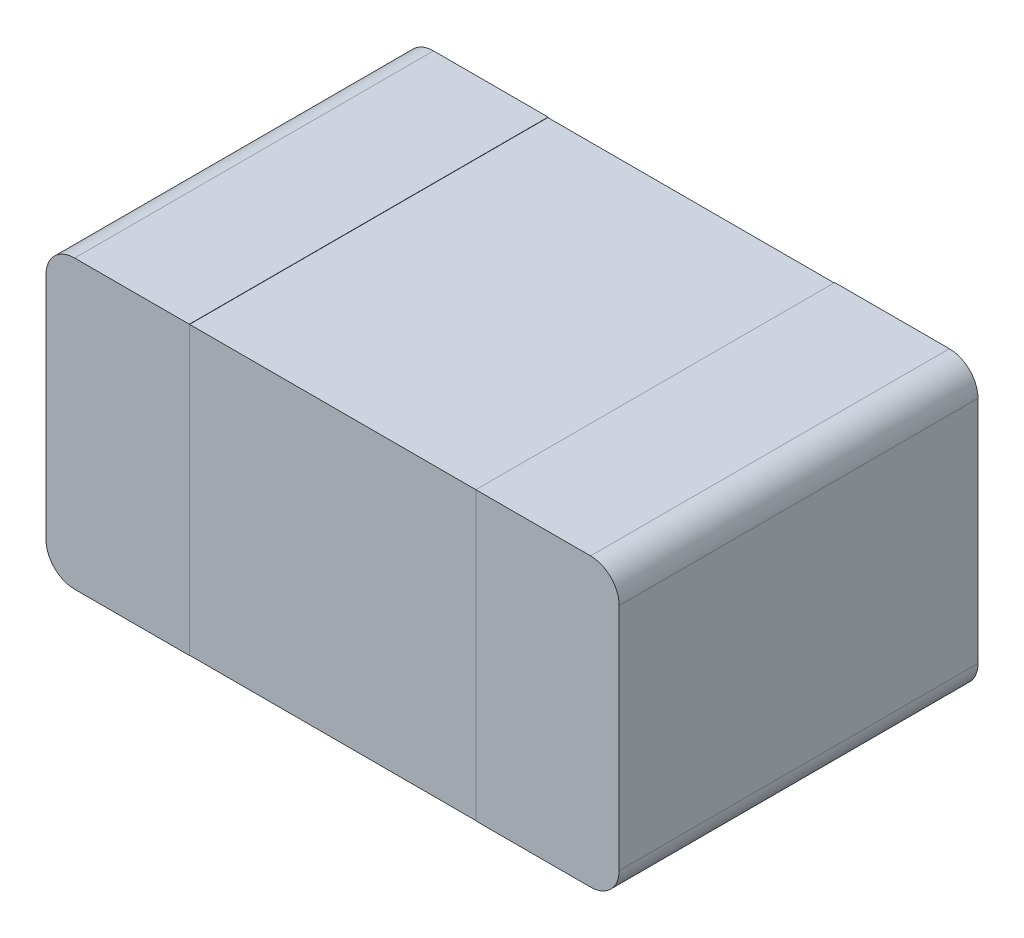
ISO-10303-21;
HEADER;
FILE_DESCRIPTION(('STEP AP214'),'2;1');
FILE_NAME('part.step','',(''),(''),'','','');
FILE_SCHEMA(('AUTOMOTIVE_DESIGN { 1 0 10303 214 1 1 1 1 }'));
ENDSEC;
DATA;
#1=APPLICATION_CONTEXT('core data for automotive mechanical design processes');
#2=APPLICATION_PROTOCOL_DEFINITION('international standard','automotive_design',2000,#1);
#3=PRODUCT_CONTEXT('',#1,'mechanical');
#4=PRODUCT('Part','Part','',(#3));
#5=PRODUCT_RELATED_PRODUCT_CATEGORY('part','',(#4));
#6=PRODUCT_DEFINITION_FORMATION('','',#4);
#7=PRODUCT_DEFINITION_CONTEXT('part definition',#1,'design');
#8=PRODUCT_DEFINITION('design','',#6,#7);
#9=PRODUCT_DEFINITION_SHAPE('','',#8);
#10=(LENGTH_UNIT() NAMED_UNIT(*) SI_UNIT(.MILLI.,.METRE.));
#11=(NAMED_UNIT(*) PLANE_ANGLE_UNIT() SI_UNIT($,.RADIAN.));
#12=(NAMED_UNIT(*) SI_UNIT($,.STERADIAN.) SOLID_ANGLE_UNIT());
#13=UNCERTAINTY_MEASURE_WITH_UNIT(LENGTH_MEASURE(1.E-05),#10,'distance_accuracy_value','');
#14=(GEOMETRIC_REPRESENTATION_CONTEXT(3) GLOBAL_UNCERTAINTY_ASSIGNED_CONTEXT((#13)) GLOBAL_UNIT_ASSIGNED_CONTEXT((#10,
#11,#12)) REPRESENTATION_CONTEXT('',''));
#15=CARTESIAN_POINT('',(0.,0.,0.));
#16=DIRECTION('',(0.,0.,1.));
#17=DIRECTION('',(1.,0.,0.));
#18=AXIS2_PLACEMENT_3D('',#15,#16,#17);
#19=CARTESIAN_POINT('',(-0.9,0.901,0.));
#20=DIRECTION('',(0.,0.,-1.));
#21=DIRECTION('',(-1.,0.,0.));
#22=AXIS2_PLACEMENT_3D('',#19,#20,#21);
#23=CYLINDRICAL_SURFACE('',#22,0.0999999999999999);
#24=CARTESIAN_POINT('',(-0.9,0.901,0.626));
#25=DIRECTION('',(0.,0.,-1.));
#26=DIRECTION('',(-1.,0.,0.));
#27=AXIS2_PLACEMENT_3D('',#24,#25,#26);
#28=CIRCLE('',#27,0.0999999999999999);
#29=CARTESIAN_POINT('',(-1.,0.901,0.626));
#30=VERTEX_POINT('',#29);
#31=CARTESIAN_POINT('',(-0.9,1.001,0.626));
#32=VERTEX_POINT('',#31);
#33=EDGE_CURVE('E110',#30,#32,#28,.T.);
#34=ORIENTED_EDGE('',*,*,#33,.T.);
#35=DIRECTION('',(0.,0.,1.));
#36=VECTOR('',#35,1.);
#37=CARTESIAN_POINT('',(-0.9,1.001,0.));
#38=LINE('',#37,#36);
#39=CARTESIAN_POINT('',(-0.9,1.001,-0.626));
#40=VERTEX_POINT('',#39);
#41=EDGE_CURVE('E109',#40,#32,#38,.T.);
#42=ORIENTED_EDGE('',*,*,#41,.F.);
#43=CARTESIAN_POINT('',(-0.9,0.901,-0.626));
#44=DIRECTION('',(0.,0.,-1.));
#45=DIRECTION('',(-1.,0.,0.));
#46=AXIS2_PLACEMENT_3D('',#43,#44,#45);
#47=CIRCLE('',#46,0.0999999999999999);
#48=CARTESIAN_POINT('',(-1.,0.901,-0.626));
#49=VERTEX_POINT('',#48);
#50=EDGE_CURVE('E22',#49,#40,#47,.T.);
#51=ORIENTED_EDGE('',*,*,#50,.F.);
#52=DIRECTION('',(0.,0.,-1.));
#53=VECTOR('',#52,1.);
#54=CARTESIAN_POINT('',(-1.,0.901,-0.625));
#55=LINE('',#54,#53);
#56=EDGE_CURVE('E92',#49,#30,#55,.F.);
#57=ORIENTED_EDGE('',*,*,#56,.T.);
#58=EDGE_LOOP('',(#34,#42,#51,#57));
#59=FACE_BOUND('',#58,.T.);
#60=ADVANCED_FACE('F19',(#59),#23,.T.);
#61=CARTESIAN_POINT('',(-1.,1.,-0.625));
#62=DIRECTION('',(1.,0.,0.));
#63=DIRECTION('',(0.,0.,-1.));
#64=AXIS2_PLACEMENT_3D('',#61,#62,#63);
#65=PLANE('',#64);
#66=DIRECTION('',(0.,0.,1.));
#67=VECTOR('',#66,1.);
#68=CARTESIAN_POINT('',(-1.,0.1,-0.625));
#69=LINE('',#68,#67);
#70=CARTESIAN_POINT('',(-1.,0.1,0.626));
#71=VERTEX_POINT('',#70);
#72=CARTESIAN_POINT('',(-1.,0.1,-0.626));
#73=VERTEX_POINT('',#72);
#74=EDGE_CURVE('E122',#71,#73,#69,.F.);
#75=ORIENTED_EDGE('',*,*,#74,.F.);
#76=DIRECTION('',(0.,1.,0.));
#77=VECTOR('',#76,1.);
#78=CARTESIAN_POINT('',(-1.,0.,0.626));
#79=LINE('',#78,#77);
#80=EDGE_CURVE('E209',#71,#30,#79,.T.);
#81=ORIENTED_EDGE('',*,*,#80,.T.);
#82=ORIENTED_EDGE('',*,*,#56,.F.);
#83=DIRECTION('',(0.,1.,0.));
#84=VECTOR('',#83,1.);
#85=CARTESIAN_POINT('',(-1.,0.,-0.626));
#86=LINE('',#85,#84);
#87=EDGE_CURVE('E106',#73,#49,#86,.T.);
#88=ORIENTED_EDGE('',*,*,#87,.F.);
#89=EDGE_LOOP('',(#75,#81,#82,#88));
#90=FACE_BOUND('',#89,.T.);
#91=ADVANCED_FACE('F496',(#90),#65,.F.);
#92=CARTESIAN_POINT('',(0.,1.001,0.));
#93=DIRECTION('',(0.,1.,0.));
#94=DIRECTION('',(0.,0.,1.));
#95=AXIS2_PLACEMENT_3D('',#92,#93,#94);
#96=PLANE('',#95);
#97=DIRECTION('',(-1.,0.,0.));
#98=VECTOR('',#97,1.);
#99=CARTESIAN_POINT('',(0.,1.001,0.626));
#100=LINE('',#99,#98);
#101=CARTESIAN_POINT('',(-0.5,1.001,0.626));
#102=VERTEX_POINT('',#101);
#103=EDGE_CURVE('E210',#32,#102,#100,.F.);
#104=ORIENTED_EDGE('',*,*,#103,.T.);
#105=DIRECTION('',(0.,0.,1.));
#106=VECTOR('',#105,1.);
#107=CARTESIAN_POINT('',(-0.5,1.001,0.625));
#108=LINE('',#107,#106);
#109=CARTESIAN_POINT('',(-0.5,1.001,-0.626));
#110=VERTEX_POINT('',#109);
#111=EDGE_CURVE('E119',#102,#110,#108,.F.);
#112=ORIENTED_EDGE('',*,*,#111,.T.);
#113=DIRECTION('',(-1.,0.,0.));
#114=VECTOR('',#113,1.);
#115=CARTESIAN_POINT('',(0.,1.001,-0.626));
#116=LINE('',#115,#114);
#117=EDGE_CURVE('E103',#40,#110,#116,.F.);
#118=ORIENTED_EDGE('',*,*,#117,.F.);
#119=ORIENTED_EDGE('',*,*,#41,.T.);
#120=EDGE_LOOP('',(#104,#112,#118,#119));
#121=FACE_BOUND('',#120,.T.);
#122=ADVANCED_FACE('F117',(#121),#96,.T.);
#123=CARTESIAN_POINT('',(0.,1.,0.));
#124=DIRECTION('',(0.,1.,0.));
#125=DIRECTION('',(0.,0.,1.));
#126=AXIS2_PLACEMENT_3D('',#123,#124,#125);
#127=PLANE('',#126);
#128=DIRECTION('',(1.,0.,0.));
#129=VECTOR('',#128,1.);
#130=CARTESIAN_POINT('',(-1.,1.,-0.625));
#131=LINE('',#130,#129);
#132=CARTESIAN_POINT('',(0.5,1.,-0.625));
#133=VERTEX_POINT('',#132);
#134=CARTESIAN_POINT('',(-0.5,1.,-0.625));
#135=VERTEX_POINT('',#134);
#136=EDGE_CURVE('E130',#133,#135,#131,.F.);
#137=ORIENTED_EDGE('',*,*,#136,.T.);
#138=DIRECTION('',(0.,0.,1.));
#139=VECTOR('',#138,1.);
#140=CARTESIAN_POINT('',(-0.5,1.,0.625));
#141=LINE('',#140,#139);
#142=CARTESIAN_POINT('',(-0.5,1.,0.625));
#143=VERTEX_POINT('',#142);
#144=EDGE_CURVE('E164',#135,#143,#141,.T.);
#145=ORIENTED_EDGE('',*,*,#144,.T.);
#146=DIRECTION('',(-1.,0.,0.));
#147=VECTOR('',#146,1.);
#148=CARTESIAN_POINT('',(-1.,1.,0.625));
#149=LINE('',#148,#147);
#150=CARTESIAN_POINT('',(0.5,1.,0.625));
#151=VERTEX_POINT('',#150);
#152=EDGE_CURVE('E148',#143,#151,#149,.F.);
#153=ORIENTED_EDGE('',*,*,#152,.T.);
#154=DIRECTION('',(0.,0.,-1.));
#155=VECTOR('',#154,1.);
#156=CARTESIAN_POINT('',(0.5,1.,0.625));
#157=LINE('',#156,#155);
#158=EDGE_CURVE('E154',#151,#133,#157,.T.);
#159=ORIENTED_EDGE('',*,*,#158,.T.);
#160=EDGE_LOOP('',(#137,#145,#153,#159));
#161=FACE_BOUND('',#160,.T.);
#162=ADVANCED_FACE('F340',(#161),#127,.T.);
#163=CARTESIAN_POINT('',(0.9,0.901,0.));
#164=DIRECTION('',(0.,0.,-1.));
#165=DIRECTION('',(-1.,0.,0.));
#166=AXIS2_PLACEMENT_3D('',#163,#164,#165);
#167=CYLINDRICAL_SURFACE('',#166,0.1);
#168=CARTESIAN_POINT('',(0.9,0.901,-0.626));
#169=DIRECTION('',(0.,0.,-1.));
#170=DIRECTION('',(-1.,0.,0.));
#171=AXIS2_PLACEMENT_3D('',#168,#169,#170);
#172=CIRCLE('',#171,0.1);
#173=CARTESIAN_POINT('',(1.,0.901,-0.626));
#174=VERTEX_POINT('',#173);
#175=CARTESIAN_POINT('',(0.9,1.001,-0.626));
#176=VERTEX_POINT('',#175);
#177=EDGE_CURVE('E137',#174,#176,#172,.F.);
#178=ORIENTED_EDGE('',*,*,#177,.T.);
#179=DIRECTION('',(0.,0.,-1.));
#180=VECTOR('',#179,1.);
#181=CARTESIAN_POINT('',(0.9,1.001,0.));
#182=LINE('',#181,#180);
#183=CARTESIAN_POINT('',(0.9,1.001,0.626));
#184=VERTEX_POINT('',#183);
#185=EDGE_CURVE('E114',#176,#184,#182,.F.);
#186=ORIENTED_EDGE('',*,*,#185,.T.);
#187=CARTESIAN_POINT('',(0.9,0.901,0.626));
#188=DIRECTION('',(0.,0.,-1.));
#189=DIRECTION('',(-1.,0.,0.));
#190=AXIS2_PLACEMENT_3D('',#187,#188,#189);
#191=CIRCLE('',#190,0.1);
#192=CARTESIAN_POINT('',(1.,0.901,0.626));
#193=VERTEX_POINT('',#192);
#194=EDGE_CURVE('E203',#193,#184,#191,.F.);
#195=ORIENTED_EDGE('',*,*,#194,.F.);
#196=DIRECTION('',(0.,0.,1.));
#197=VECTOR('',#196,1.);
#198=CARTESIAN_POINT('',(1.,0.901,-0.625));
#199=LINE('',#198,#197);
#200=EDGE_CURVE('E131',#193,#174,#199,.F.);
#201=ORIENTED_EDGE('',*,*,#200,.T.);
#202=EDGE_LOOP('',(#178,#186,#195,#201));
#203=FACE_BOUND('',#202,.T.);
#204=ADVANCED_FACE('F328',(#203),#167,.T.);
#205=CARTESIAN_POINT('',(0.,1.001,0.));
#206=DIRECTION('',(0.,-1.,0.));
#207=DIRECTION('',(0.,0.,-1.));
#208=AXIS2_PLACEMENT_3D('',#205,#206,#207);
#209=PLANE('',#208);
#210=ORIENTED_EDGE('',*,*,#185,.F.);
#211=DIRECTION('',(1.,0.,0.));
#212=VECTOR('',#211,1.);
#213=CARTESIAN_POINT('',(0.,1.001,-0.626));
#214=LINE('',#213,#212);
#215=CARTESIAN_POINT('',(0.5,1.001,-0.626));
#216=VERTEX_POINT('',#215);
#217=EDGE_CURVE('E200',#176,#216,#214,.F.);
#218=ORIENTED_EDGE('',*,*,#217,.T.);
#219=DIRECTION('',(0.,0.,-1.));
#220=VECTOR('',#219,1.);
#221=CARTESIAN_POINT('',(0.5,1.001,0.625));
#222=LINE('',#221,#220);
#223=CARTESIAN_POINT('',(0.5,1.001,0.626));
#224=VERTEX_POINT('',#223);
#225=EDGE_CURVE('E139',#216,#224,#222,.F.);
#226=ORIENTED_EDGE('',*,*,#225,.T.);
#227=DIRECTION('',(1.,0.,0.));
#228=VECTOR('',#227,1.);
#229=CARTESIAN_POINT('',(0.,1.001,0.626));
#230=LINE('',#229,#228);
#231=EDGE_CURVE('E205',#184,#224,#230,.F.);
#232=ORIENTED_EDGE('',*,*,#231,.F.);
#233=EDGE_LOOP('',(#210,#218,#226,#232));
#234=FACE_BOUND('',#233,.T.);
#235=ADVANCED_FACE('F331',(#234),#209,.F.);
#236=CARTESIAN_POINT('',(1.,1.,-0.625));
#237=DIRECTION('',(-1.,0.,0.));
#238=DIRECTION('',(0.,0.,1.));
#239=AXIS2_PLACEMENT_3D('',#236,#237,#238);
#240=PLANE('',#239);
#241=DIRECTION('',(0.,0.,-1.));
#242=VECTOR('',#241,1.);
#243=CARTESIAN_POINT('',(1.,0.1,-0.625));
#244=LINE('',#243,#242);
#245=CARTESIAN_POINT('',(1.,0.1,-0.626));
#246=VERTEX_POINT('',#245);
#247=CARTESIAN_POINT('',(1.,0.1,0.626));
#248=VERTEX_POINT('',#247);
#249=EDGE_CURVE('E134',#246,#248,#244,.F.);
#250=ORIENTED_EDGE('',*,*,#249,.F.);
#251=DIRECTION('',(0.,1.,0.));
#252=VECTOR('',#251,1.);
#253=CARTESIAN_POINT('',(1.,0.,-0.626));
#254=LINE('',#253,#252);
#255=EDGE_CURVE('E195',#246,#174,#254,.T.);
#256=ORIENTED_EDGE('',*,*,#255,.T.);
#257=ORIENTED_EDGE('',*,*,#200,.F.);
#258=DIRECTION('',(0.,1.,0.));
#259=VECTOR('',#258,1.);
#260=CARTESIAN_POINT('',(1.,0.,0.626));
#261=LINE('',#260,#259);
#262=EDGE_CURVE('E157',#248,#193,#261,.T.);
#263=ORIENTED_EDGE('',*,*,#262,.F.);
#264=EDGE_LOOP('',(#250,#256,#257,#263));
#265=FACE_BOUND('',#264,.T.);
#266=ADVANCED_FACE('F325',(#265),#240,.F.);
#267=CARTESIAN_POINT('',(-1.,1.,-0.625));
#268=DIRECTION('',(0.,0.,1.));
#269=DIRECTION('',(1.,0.,0.));
#270=AXIS2_PLACEMENT_3D('',#267,#268,#269);
#271=PLANE('',#270);
#272=ORIENTED_EDGE('',*,*,#136,.F.);
#273=DIRECTION('',(0.,1.,0.));
#274=VECTOR('',#273,1.);
#275=CARTESIAN_POINT('',(0.5,1.001,-0.625));
#276=LINE('',#275,#274);
#277=CARTESIAN_POINT('',(0.5,0.,-0.625));
#278=VERTEX_POINT('',#277);
#279=EDGE_CURVE('E143',#133,#278,#276,.F.);
#280=ORIENTED_EDGE('',*,*,#279,.T.);
#281=DIRECTION('',(1.,0.,0.));
#282=VECTOR('',#281,1.);
#283=CARTESIAN_POINT('',(0.,0.,-0.625));
#284=LINE('',#283,#282);
#285=CARTESIAN_POINT('',(-0.5,0.,-0.625));
#286=VERTEX_POINT('',#285);
#287=EDGE_CURVE('E191',#278,#286,#284,.F.);
#288=ORIENTED_EDGE('',*,*,#287,.T.);
#289=DIRECTION('',(0.,1.,0.));
#290=VECTOR('',#289,1.);
#291=CARTESIAN_POINT('',(-0.5,1.001,-0.625));
#292=LINE('',#291,#290);
#293=EDGE_CURVE('E167',#286,#135,#292,.T.);
#294=ORIENTED_EDGE('',*,*,#293,.T.);
#295=EDGE_LOOP('',(#272,#280,#288,#294));
#296=FACE_BOUND('',#295,.T.);
#297=ADVANCED_FACE('F316',(#296),#271,.F.);
#298=CARTESIAN_POINT('',(0.,0.,-0.626));
#299=DIRECTION('',(0.,0.,-1.));
#300=DIRECTION('',(-1.,0.,0.));
#301=AXIS2_PLACEMENT_3D('',#298,#299,#300);
#302=PLANE('',#301);
#303=ORIENTED_EDGE('',*,*,#117,.T.);
#304=DIRECTION('',(0.,1.,0.));
#305=VECTOR('',#304,1.);
#306=CARTESIAN_POINT('',(-0.5,1.001,-0.626));
#307=LINE('',#306,#305);
#308=CARTESIAN_POINT('',(-0.5,0.,-0.626));
#309=VERTEX_POINT('',#308);
#310=EDGE_CURVE('E171',#110,#309,#307,.F.);
#311=ORIENTED_EDGE('',*,*,#310,.T.);
#312=DIRECTION('',(1.,0.,0.));
#313=VECTOR('',#312,1.);
#314=CARTESIAN_POINT('',(0.,0.,-0.626));
#315=LINE('',#314,#313);
#316=CARTESIAN_POINT('',(-0.9,0.,-0.626));
#317=VERTEX_POINT('',#316);
#318=EDGE_CURVE('E190',#309,#317,#315,.F.);
#319=ORIENTED_EDGE('',*,*,#318,.T.);
#320=CARTESIAN_POINT('',(-0.9,0.1,-0.626));
#321=DIRECTION('',(0.,0.,1.));
#322=DIRECTION('',(1.,0.,0.));
#323=AXIS2_PLACEMENT_3D('',#320,#321,#322);
#324=CIRCLE('',#323,0.1);
#325=EDGE_CURVE('E120',#73,#317,#324,.T.);
#326=ORIENTED_EDGE('',*,*,#325,.F.);
#327=ORIENTED_EDGE('',*,*,#87,.T.);
#328=ORIENTED_EDGE('',*,*,#50,.T.);
#329=EDGE_LOOP('',(#303,#311,#319,#326,#327,#328));
#330=FACE_BOUND('',#329,.T.);
#331=ADVANCED_FACE('F99',(#330),#302,.T.);
#332=CARTESIAN_POINT('',(-0.9,0.1,-0.625));
#333=DIRECTION('',(0.,0.,1.));
#334=DIRECTION('',(1.,0.,0.));
#335=AXIS2_PLACEMENT_3D('',#332,#333,#334);
#336=CYLINDRICAL_SURFACE('',#335,0.1);
#337=CARTESIAN_POINT('',(-0.9,0.1,0.626));
#338=DIRECTION('',(0.,0.,1.));
#339=DIRECTION('',(1.,0.,0.));
#340=AXIS2_PLACEMENT_3D('',#337,#338,#339);
#341=CIRCLE('',#340,0.1);
#342=CARTESIAN_POINT('',(-0.9,0.,0.626));
#343=VERTEX_POINT('',#342);
#344=EDGE_CURVE('E206',#343,#71,#341,.F.);
#345=ORIENTED_EDGE('',*,*,#344,.T.);
#346=ORIENTED_EDGE('',*,*,#74,.T.);
#347=ORIENTED_EDGE('',*,*,#325,.T.);
#348=DIRECTION('',(0.,0.,1.));
#349=VECTOR('',#348,1.);
#350=CARTESIAN_POINT('',(-0.9,0.,0.));
#351=LINE('',#350,#349);
#352=EDGE_CURVE('E125',#317,#343,#351,.T.);
#353=ORIENTED_EDGE('',*,*,#352,.T.);
#354=EDGE_LOOP('',(#345,#346,#347,#353));
#355=FACE_BOUND('',#354,.T.);
#356=ADVANCED_FACE('F364',(#355),#336,.T.);
#357=CARTESIAN_POINT('',(0.,0.,0.626));
#358=DIRECTION('',(0.,0.,-1.));
#359=DIRECTION('',(-1.,0.,0.));
#360=AXIS2_PLACEMENT_3D('',#357,#358,#359);
#361=PLANE('',#360);
#362=ORIENTED_EDGE('',*,*,#344,.F.);
#363=DIRECTION('',(1.,0.,0.));
#364=VECTOR('',#363,1.);
#365=CARTESIAN_POINT('',(0.,0.,0.626));
#366=LINE('',#365,#364);
#367=CARTESIAN_POINT('',(-0.5,0.,0.626));
#368=VERTEX_POINT('',#367);
#369=EDGE_CURVE('E186',#343,#368,#366,.T.);
#370=ORIENTED_EDGE('',*,*,#369,.T.);
#371=DIRECTION('',(0.,1.,0.));
#372=VECTOR('',#371,1.);
#373=CARTESIAN_POINT('',(-0.5,1.001,0.626));
#374=LINE('',#373,#372);
#375=EDGE_CURVE('E172',#368,#102,#374,.T.);
#376=ORIENTED_EDGE('',*,*,#375,.T.);
#377=ORIENTED_EDGE('',*,*,#103,.F.);
#378=ORIENTED_EDGE('',*,*,#33,.F.);
#379=ORIENTED_EDGE('',*,*,#80,.F.);
#380=EDGE_LOOP('',(#362,#370,#376,#377,#378,#379));
#381=FACE_BOUND('',#380,.T.);
#382=ADVANCED_FACE('F360',(#381),#361,.F.);
#383=CARTESIAN_POINT('',(-0.5,1.001,0.625));
#384=DIRECTION('',(-1.,0.,0.));
#385=DIRECTION('',(0.,0.,1.));
#386=AXIS2_PLACEMENT_3D('',#383,#384,#385);
#387=PLANE('',#386);
#388=ORIENTED_EDGE('',*,*,#293,.F.);
#389=DIRECTION('',(0.,0.,1.));
#390=VECTOR('',#389,1.);
#391=CARTESIAN_POINT('',(-0.5,0.,0.625));
#392=LINE('',#391,#390);
#393=EDGE_CURVE('E187',#286,#309,#392,.F.);
#394=ORIENTED_EDGE('',*,*,#393,.T.);
#395=ORIENTED_EDGE('',*,*,#310,.F.);
#396=ORIENTED_EDGE('',*,*,#111,.F.);
#397=ORIENTED_EDGE('',*,*,#375,.F.);
#398=DIRECTION('',(0.,0.,1.));
#399=VECTOR('',#398,1.);
#400=CARTESIAN_POINT('',(-0.5,0.,0.625));
#401=LINE('',#400,#399);
#402=CARTESIAN_POINT('',(-0.5,0.,0.625));
#403=VERTEX_POINT('',#402);
#404=EDGE_CURVE('E183',#368,#403,#401,.F.);
#405=ORIENTED_EDGE('',*,*,#404,.T.);
#406=DIRECTION('',(0.,1.,0.));
#407=VECTOR('',#406,1.);
#408=CARTESIAN_POINT('',(-0.5,1.,0.625));
#409=LINE('',#408,#407);
#410=EDGE_CURVE('E151',#403,#143,#409,.T.);
#411=ORIENTED_EDGE('',*,*,#410,.T.);
#412=ORIENTED_EDGE('',*,*,#144,.F.);
#413=EDGE_LOOP('',(#388,#394,#395,#396,#397,#405,#411,#412));
#414=FACE_BOUND('',#413,.T.);
#415=ADVANCED_FACE('F357',(#414),#387,.F.);
#416=CARTESIAN_POINT('',(-1.,1.,0.625));
#417=DIRECTION('',(0.,0.,-1.));
#418=DIRECTION('',(-1.,0.,0.));
#419=AXIS2_PLACEMENT_3D('',#416,#417,#418);
#420=PLANE('',#419);
#421=ORIENTED_EDGE('',*,*,#152,.F.);
#422=ORIENTED_EDGE('',*,*,#410,.F.);
#423=DIRECTION('',(1.,0.,0.));
#424=VECTOR('',#423,1.);
#425=CARTESIAN_POINT('',(0.,0.,0.625));
#426=LINE('',#425,#424);
#427=CARTESIAN_POINT('',(0.5,0.,0.625));
#428=VERTEX_POINT('',#427);
#429=EDGE_CURVE('E182',#403,#428,#426,.T.);
#430=ORIENTED_EDGE('',*,*,#429,.T.);
#431=DIRECTION('',(0.,1.,0.));
#432=VECTOR('',#431,1.);
#433=CARTESIAN_POINT('',(0.5,1.001,0.625));
#434=LINE('',#433,#432);
#435=EDGE_CURVE('E142',#428,#151,#434,.T.);
#436=ORIENTED_EDGE('',*,*,#435,.T.);
#437=EDGE_LOOP('',(#421,#422,#430,#436));
#438=FACE_BOUND('',#437,.T.);
#439=ADVANCED_FACE('F291',(#438),#420,.F.);
#440=CARTESIAN_POINT('',(0.5,1.001,0.625));
#441=DIRECTION('',(1.,0.,0.));
#442=DIRECTION('',(0.,0.,-1.));
#443=AXIS2_PLACEMENT_3D('',#440,#441,#442);
#444=PLANE('',#443);
#445=ORIENTED_EDGE('',*,*,#435,.F.);
#446=DIRECTION('',(0.,0.,-1.));
#447=VECTOR('',#446,1.);
#448=CARTESIAN_POINT('',(0.5,0.,0.625));
#449=LINE('',#448,#447);
#450=CARTESIAN_POINT('',(0.5,0.,0.626));
#451=VERTEX_POINT('',#450);
#452=EDGE_CURVE('E178',#428,#451,#449,.F.);
#453=ORIENTED_EDGE('',*,*,#452,.T.);
#454=DIRECTION('',(0.,1.,0.));
#455=VECTOR('',#454,1.);
#456=CARTESIAN_POINT('',(0.5,0.,0.626));
#457=LINE('',#456,#455);
#458=EDGE_CURVE('E202',#224,#451,#457,.F.);
#459=ORIENTED_EDGE('',*,*,#458,.F.);
#460=ORIENTED_EDGE('',*,*,#225,.F.);
#461=DIRECTION('',(0.,1.,0.));
#462=VECTOR('',#461,1.);
#463=CARTESIAN_POINT('',(0.5,0.,-0.626));
#464=LINE('',#463,#462);
#465=CARTESIAN_POINT('',(0.5,0.,-0.626));
#466=VERTEX_POINT('',#465);
#467=EDGE_CURVE('E197',#216,#466,#464,.F.);
#468=ORIENTED_EDGE('',*,*,#467,.T.);
#469=DIRECTION('',(0.,0.,-1.));
#470=VECTOR('',#469,1.);
#471=CARTESIAN_POINT('',(0.5,0.,0.625));
#472=LINE('',#471,#470);
#473=EDGE_CURVE('E192',#466,#278,#472,.F.);
#474=ORIENTED_EDGE('',*,*,#473,.T.);
#475=ORIENTED_EDGE('',*,*,#279,.F.);
#476=ORIENTED_EDGE('',*,*,#158,.F.);
#477=EDGE_LOOP('',(#445,#453,#459,#460,#468,#474,#475,#476));
#478=FACE_BOUND('',#477,.T.);
#479=ADVANCED_FACE('F283',(#478),#444,.F.);
#480=CARTESIAN_POINT('',(0.,0.,0.626));
#481=DIRECTION('',(0.,0.,1.));
#482=DIRECTION('',(1.,0.,0.));
#483=AXIS2_PLACEMENT_3D('',#480,#481,#482);
#484=PLANE('',#483);
#485=ORIENTED_EDGE('',*,*,#231,.T.);
#486=ORIENTED_EDGE('',*,*,#458,.T.);
#487=DIRECTION('',(1.,0.,0.));
#488=VECTOR('',#487,1.);
#489=CARTESIAN_POINT('',(0.,0.,0.626));
#490=LINE('',#489,#488);
#491=CARTESIAN_POINT('',(0.9,0.,0.626));
#492=VERTEX_POINT('',#491);
#493=EDGE_CURVE('E181',#451,#492,#490,.T.);
#494=ORIENTED_EDGE('',*,*,#493,.T.);
#495=CARTESIAN_POINT('',(0.9,0.1,0.626));
#496=DIRECTION('',(0.,0.,-1.));
#497=DIRECTION('',(-1.,0.,0.));
#498=AXIS2_PLACEMENT_3D('',#495,#496,#497);
#499=CIRCLE('',#498,0.1);
#500=EDGE_CURVE('E138',#248,#492,#499,.T.);
#501=ORIENTED_EDGE('',*,*,#500,.F.);
#502=ORIENTED_EDGE('',*,*,#262,.T.);
#503=ORIENTED_EDGE('',*,*,#194,.T.);
#504=EDGE_LOOP('',(#485,#486,#494,#501,#502,#503));
#505=FACE_BOUND('',#504,.T.);
#506=ADVANCED_FACE('F272',(#505),#484,.T.);
#507=CARTESIAN_POINT('',(0.9,0.1,-0.625));
#508=DIRECTION('',(0.,0.,-1.));
#509=DIRECTION('',(-1.,0.,0.));
#510=AXIS2_PLACEMENT_3D('',#507,#508,#509);
#511=CYLINDRICAL_SURFACE('',#510,0.1);
#512=CARTESIAN_POINT('',(0.9,0.1,-0.626));
#513=DIRECTION('',(0.,0.,-1.));
#514=DIRECTION('',(-1.,0.,0.));
#515=AXIS2_PLACEMENT_3D('',#512,#513,#514);
#516=CIRCLE('',#515,0.1);
#517=CARTESIAN_POINT('',(0.9,0.,-0.626));
#518=VERTEX_POINT('',#517);
#519=EDGE_CURVE('E36',#518,#246,#516,.F.);
#520=ORIENTED_EDGE('',*,*,#519,.T.);
#521=ORIENTED_EDGE('',*,*,#249,.T.);
#522=ORIENTED_EDGE('',*,*,#500,.T.);
#523=DIRECTION('',(0.,0.,1.));
#524=VECTOR('',#523,1.);
#525=CARTESIAN_POINT('',(0.9,0.,0.));
#526=LINE('',#525,#524);
#527=EDGE_CURVE('E28',#492,#518,#526,.F.);
#528=ORIENTED_EDGE('',*,*,#527,.T.);
#529=EDGE_LOOP('',(#520,#521,#522,#528));
#530=FACE_BOUND('',#529,.T.);
#531=ADVANCED_FACE('F323',(#530),#511,.T.);
#532=CARTESIAN_POINT('',(0.,0.,-0.626));
#533=DIRECTION('',(0.,0.,1.));
#534=DIRECTION('',(1.,0.,0.));
#535=AXIS2_PLACEMENT_3D('',#532,#533,#534);
#536=PLANE('',#535);
#537=ORIENTED_EDGE('',*,*,#519,.F.);
#538=DIRECTION('',(1.,0.,0.));
#539=VECTOR('',#538,1.);
#540=CARTESIAN_POINT('',(0.,0.,-0.626));
#541=LINE('',#540,#539);
#542=EDGE_CURVE('E11',#518,#466,#541,.F.);
#543=ORIENTED_EDGE('',*,*,#542,.T.);
#544=ORIENTED_EDGE('',*,*,#467,.F.);
#545=ORIENTED_EDGE('',*,*,#217,.F.);
#546=ORIENTED_EDGE('',*,*,#177,.F.);
#547=ORIENTED_EDGE('',*,*,#255,.F.);
#548=EDGE_LOOP('',(#537,#543,#544,#545,#546,#547));
#549=FACE_BOUND('',#548,.T.);
#550=ADVANCED_FACE('F321',(#549),#536,.F.);
#551=CARTESIAN_POINT('',(0.,0.,0.));
#552=DIRECTION('',(0.,1.,0.));
#553=DIRECTION('',(0.,0.,1.));
#554=AXIS2_PLACEMENT_3D('',#551,#552,#553);
#555=PLANE('',#554);
#556=ORIENTED_EDGE('',*,*,#527,.F.);
#557=ORIENTED_EDGE('',*,*,#493,.F.);
#558=ORIENTED_EDGE('',*,*,#452,.F.);
#559=ORIENTED_EDGE('',*,*,#429,.F.);
#560=ORIENTED_EDGE('',*,*,#404,.F.);
#561=ORIENTED_EDGE('',*,*,#369,.F.);
#562=ORIENTED_EDGE('',*,*,#352,.F.);
#563=ORIENTED_EDGE('',*,*,#318,.F.);
#564=ORIENTED_EDGE('',*,*,#393,.F.);
#565=ORIENTED_EDGE('',*,*,#287,.F.);
#566=ORIENTED_EDGE('',*,*,#473,.F.);
#567=ORIENTED_EDGE('',*,*,#542,.F.);
#568=EDGE_LOOP('',(#556,#557,#558,#559,#560,#561,#562,#563,#564,#565,#566,#567));
#569=FACE_BOUND('',#568,.T.);
#570=ADVANCED_FACE('F277',(#569),#555,.F.);
#571=CLOSED_SHELL('',(#60,#91,#122,#162,#204,#235,#266,#297,#331,#356,#382,#415,#439,#479,#506,
#531,#550,#570));
#572=MANIFOLD_SOLID_BREP('B1',#571);
#573=ADVANCED_BREP_SHAPE_REPRESENTATION('',(#18,#572),#14);
#574=SHAPE_DEFINITION_REPRESENTATION(#9,#573);
ENDSEC;
END-ISO-10303-21;
